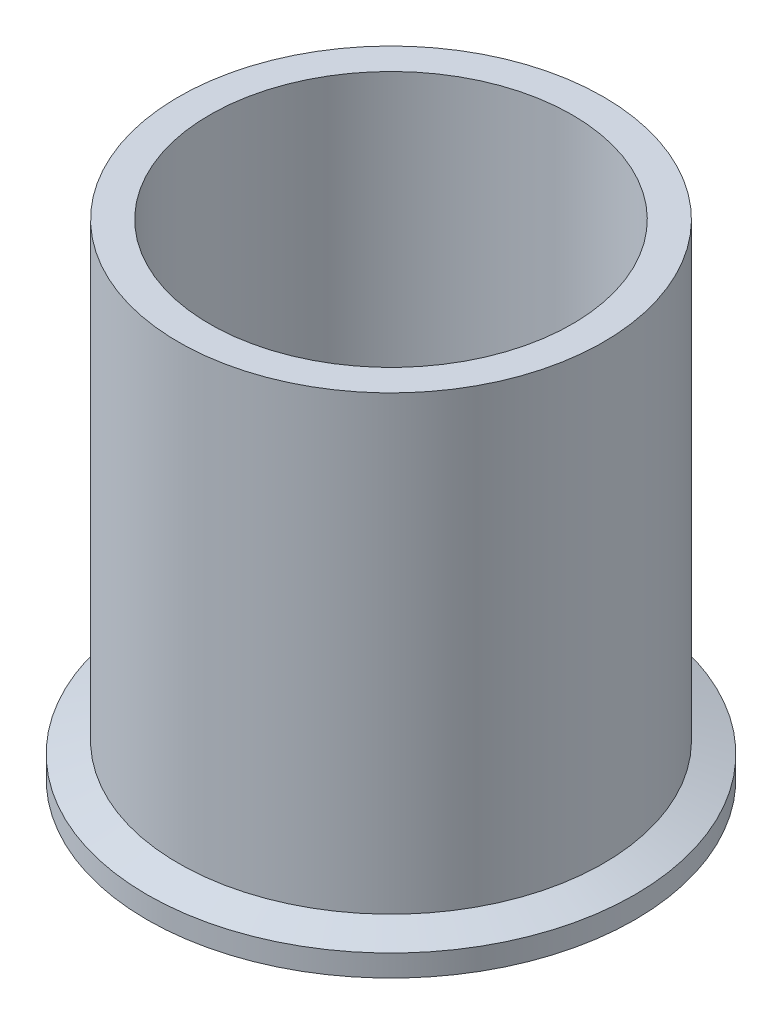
from build123d import *


with BuildPart() as part:
    # Sketch1 → Revolve2 (revolve)
    with BuildSketch(Plane.XY, mode=Mode.PRIVATE) as revolve2_sk:
        with BuildLine():
            Line((-23.749, 0), (-23.749, 63.5))
            Line((-23.749, 63.5), (-27.8384, 63.5))
            Line((-27.8384, 63.5), (-27.8384, 4.34246472))
            Line((-27.8384, 4.34246472), (-31.9532, 2.8448))
            Line((-31.9532, 2.8448), (-31.9532, 0))
            Line((-31.9532, 0), (-29.974241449, 0))
            ThreePointArc((-29.974241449, 0), (-29.69385746, 0.084386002), (-29.506624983, 0.309508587))
            Line((-29.506624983, 0.309508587), (-29.267498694, 0.872854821))
            ThreePointArc((-29.267498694, 0.872854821), (-28.1686, 1.6002), (-27.069701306, 0.872854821))
            Line((-27.069701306, 0.872854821), (-26.830575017, 0.309508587))
            ThreePointArc((-26.830575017, 0.309508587), (-26.64334254, 0.084386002), (-26.362958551, 0))
            Line((-26.362958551, 0), (-23.749, 0))
        make_face()
    revolve(revolve2_sk.sketch.rotate(Axis((0, 0, 0), (0, 1, 0)), 270), axis=Axis((0, 0, 0), (0, 1, 0)))


solid = part.part
